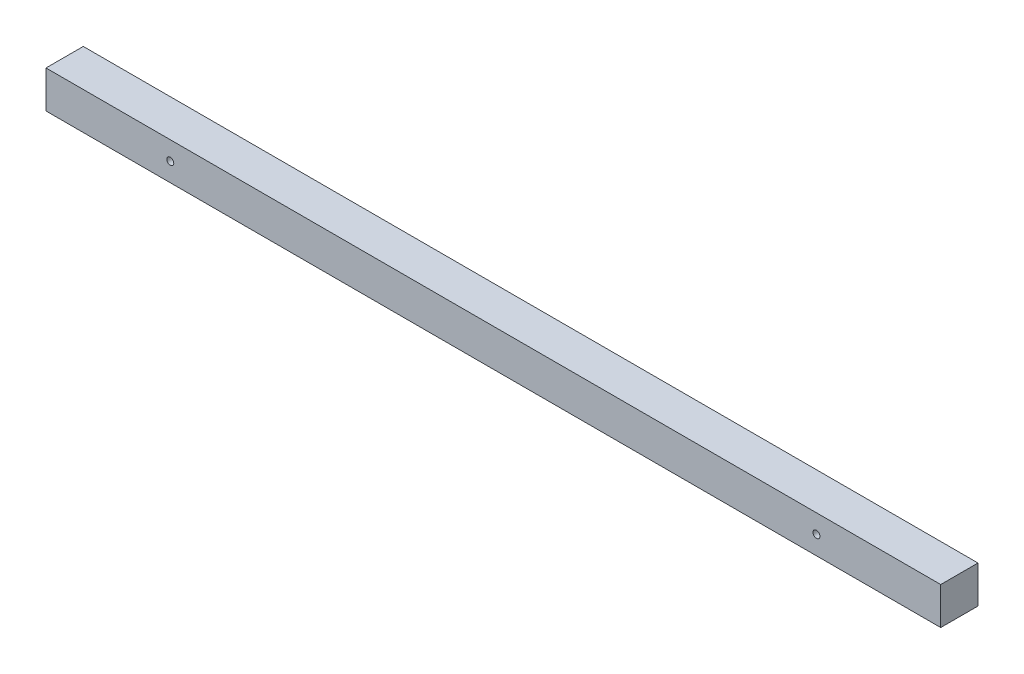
from build123d import *

# Parameters (mm, degrees)
SKETCH1_W           = 38.1
SKETCH1_H           = 38.1
BOSS_EXTRUDE1_DEPTH = 457.2
SKETCH2_R           = 3.5687
CUT_EXTRUDE1_DEPTH  = 460.180087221


with BuildPart() as part:
    # Sketch1 → Boss-Extrude1 (new, symmetric)
    with BuildSketch(Plane(origin=(0, 0, 0), x_dir=(0, 0, -1), z_dir=(1, 0, 0))):
        Rectangle(SKETCH1_W, SKETCH1_H)
    extrude(amount=BOSS_EXTRUDE1_DEPTH, both=True)

    # Sketch2 → Cut-Extrude1 (cut, through all)
    with BuildSketch(Plane.XY.offset(19.05)):
        with Locations((-330.2, 0)):
            Circle(SKETCH2_R)
        with Locations((330.2, 0)):
            Circle(SKETCH2_R)
    extrude(amount=-CUT_EXTRUDE1_DEPTH, mode=Mode.SUBTRACT)


solid = part.part
